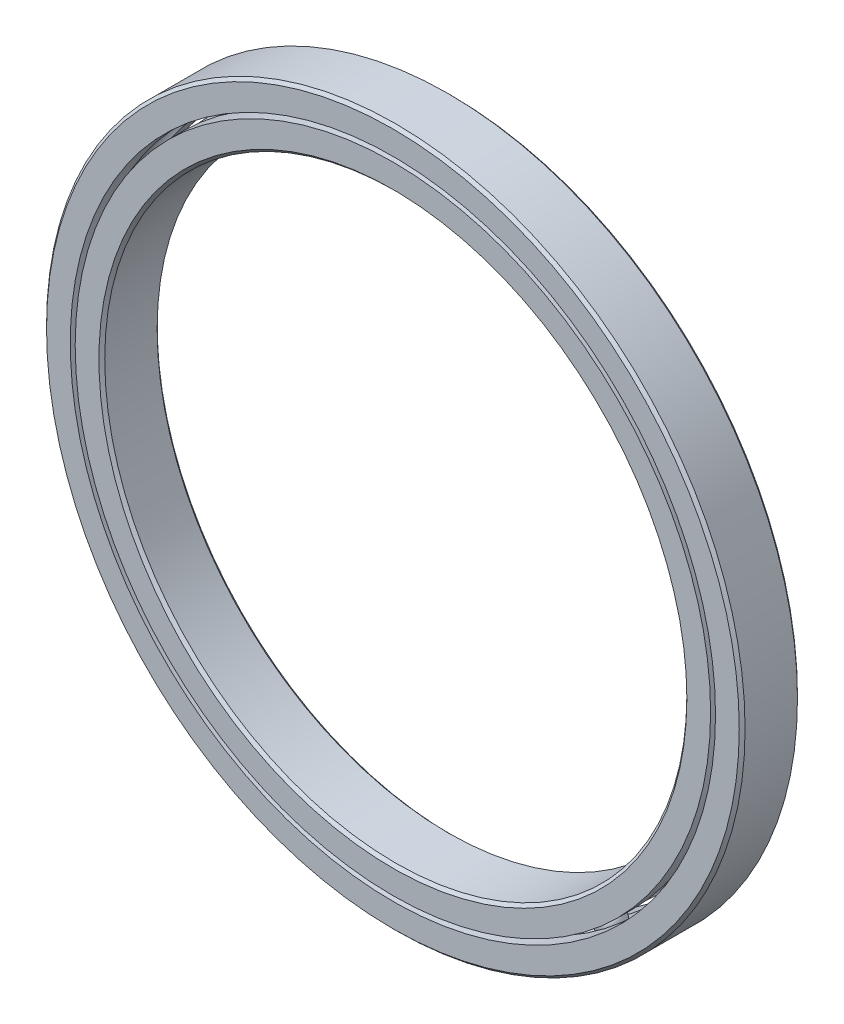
from build123d import *

# Parameters (mm, degrees)
CIRPATTERN1_COUNT = 10


with BuildPart() as part:
    # Sketch1 → Revolve1 (revolve)
    with BuildSketch(Plane(origin=(0, 0, 0), x_dir=(0, 0, -1), z_dir=(1, 0, 0)), mode=Mode.PRIVATE) as revolve1_sk:
        with BuildLine():
            Line((2.8575, 38.1), (-2.8575, 38.1))
            Line((-2.8575, 38.1), (-3.175, 37.7825))
            Line((-3.175, 37.7825), (-3.175, 35.193653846))
            Line((-3.175, 35.193653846), (-1.411111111, 35.193653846))
            ThreePointArc((-1.411111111, 35.193653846), (0, 36.361457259), (1.411111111, 35.193653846))
            Line((1.411111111, 35.193653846), (3.175, 35.193653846))
            Line((3.175, 35.193653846), (3.175, 37.7825))
            Line((3.175, 37.7825), (2.8575, 38.1))
        make_face()
    revolve(revolve1_sk.sketch.rotate(Axis((0, 0, 3.175), (0, 0, -1)), 90), axis=Axis((0, 0, 3.175), (0, 0, -1)))


with BuildPart() as body_2:
    # Sketch3 → Revolve3 (revolve)
    with BuildSketch(Plane(origin=(0, 0, 0), x_dir=(0, 0, -1), z_dir=(1, 0, 0)), mode=Mode.PRIVATE) as revolve3_sk:
        with BuildLine():
            Line((-3.175, 34.656346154), (-1.411111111, 34.656346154))
            ThreePointArc((-1.411111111, 34.656346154), (0, 33.488542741), (1.411111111, 34.656346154))
            Line((1.411111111, 34.656346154), (3.175, 34.656346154))
            Line((3.175, 34.656346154), (3.175, 32.0675))
            Line((3.175, 32.0675), (2.8575, 31.75))
            Line((2.8575, 31.75), (-2.8575, 31.75))
            Line((-2.8575, 31.75), (-3.175, 32.0675))
            Line((-3.175, 32.0675), (-3.175, 34.656346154))
        make_face()
    revolve(revolve3_sk.sketch.rotate(Axis((0, 0, 3.175), (0, 0, -1)), 90), axis=Axis((0, 0, 3.175), (0, 0, -1)))


with BuildPart() as body_3:
    # Sketch4 → Revolve4 (revolve)
    with BuildSketch(Plane(origin=(0, 0, 0), x_dir=(0, 0, -1), z_dir=(1, 0, 0))):
        with BuildLine():
            Line((-1.436457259, 34.925), (1.436457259, 34.925))
            ThreePointArc((1.436457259, 34.925), (0, 36.361457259), (-1.436457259, 34.925))
        make_face()
    revolve(axis=Axis((0, 34.925, 1.436457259), (0, 0, -1)))


with BuildPart() as cirpattern1_1:
    # CirPattern1: pattern copy
    add(body_3.part.rotate(Axis((0, 0, 0), (0, 0, 1)), 1 * 360 / CIRPATTERN1_COUNT))


with BuildPart() as cirpattern1_2:
    # CirPattern1: pattern copy
    add(body_3.part.rotate(Axis((0, 0, 0), (0, 0, 1)), 2 * 360 / CIRPATTERN1_COUNT))


with BuildPart() as cirpattern1_3:
    # CirPattern1: pattern copy
    add(body_3.part.rotate(Axis((0, 0, 0), (0, 0, 1)), 3 * 360 / CIRPATTERN1_COUNT))


with BuildPart() as cirpattern1_4:
    # CirPattern1: pattern copy
    add(body_3.part.rotate(Axis((0, 0, 0), (0, 0, 1)), 4 * 360 / CIRPATTERN1_COUNT))


with BuildPart() as cirpattern1_5:
    # CirPattern1: pattern copy
    add(body_3.part.rotate(Axis((0, 0, 0), (0, 0, 1)), 5 * 360 / CIRPATTERN1_COUNT))


with BuildPart() as cirpattern1_6:
    # CirPattern1: pattern copy
    add(body_3.part.rotate(Axis((0, 0, 0), (0, 0, 1)), 6 * 360 / CIRPATTERN1_COUNT))


with BuildPart() as cirpattern1_7:
    # CirPattern1: pattern copy
    add(body_3.part.rotate(Axis((0, 0, 0), (0, 0, 1)), 7 * 360 / CIRPATTERN1_COUNT))


with BuildPart() as cirpattern1_8:
    # CirPattern1: pattern copy
    add(body_3.part.rotate(Axis((0, 0, 0), (0, 0, 1)), 8 * 360 / CIRPATTERN1_COUNT))


with BuildPart() as cirpattern1_9:
    # CirPattern1: pattern copy
    add(body_3.part.rotate(Axis((0, 0, 0), (0, 0, 1)), 9 * 360 / CIRPATTERN1_COUNT))


solid = Compound([part.part, body_2.part, body_3.part, cirpattern1_1.part, cirpattern1_2.part, cirpattern1_3.part, cirpattern1_4.part, cirpattern1_5.part, cirpattern1_6.part, cirpattern1_7.part, cirpattern1_8.part, cirpattern1_9.part])
